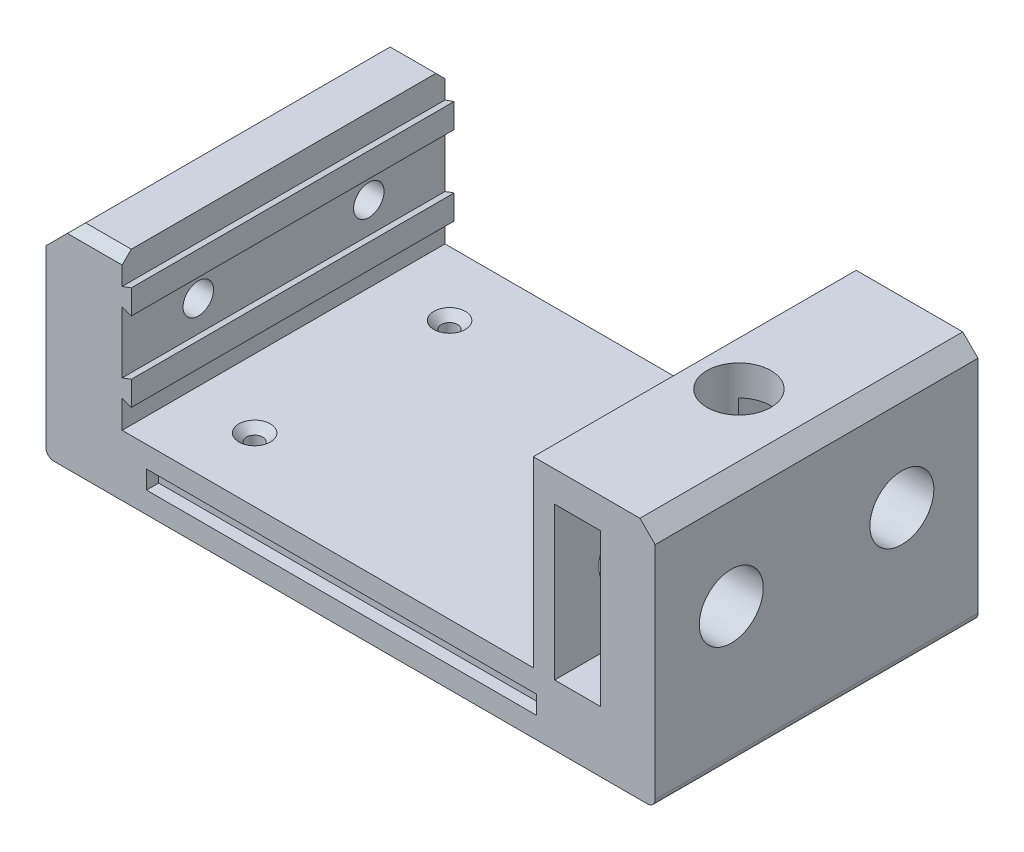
from build123d import *

# Parameters (mm, degrees)
EXTRUDE_1_DEPTH      = 53
SKETCH_2_R           = 10.5
CUT_EXTRUDE_1_DEPTH  = 179.910592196
SKETCH_3_W           = 15
SKETCH_3_H           = 50
CUT_EXTRUDE_2_DEPTH  = 163.456917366
CUT_EXTRUDE_3_REACH  = 146.102
SKETCH_4_R           = 10.5
SKETCH_5_R           = 10.5
CUT_EXTRUDE_4_DEPTH  = 8
SKETCH_6_R           = 7
CUT_EXTRUDE_5_DEPTH  = 138.801487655
SKETCH_7_R           = 13.5
CUT_EXTRUDE_6_DEPTH  = 7
SKETCH_8_R           = 5
CUT_EXTRUDE_7_DEPTH  = 193.442199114
SKETCH_9_W           = 128
SKETCH_9_H           = 6
CUT_EXTRUDE_8_DEPTH  = 4
EXTRUDE_2_DEPTH      = 106
CHAMFER_1_SIZE       = 5
CHAMFER_2_SIZE       = 3
FILLET_1_R           = 2.5
SKETCH_13_R          = 2.675
CUT_EXTRUDE_11_DEPTH = 135.034510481
CHAMFER_3_SIZE       = 2.5
CHAMFER_4_SIZE       = 2


with BuildPart() as part:
    # Sketch 1 → Extrude 1 (new, symmetric)
    with BuildSketch(Plane.XY):
        Polygon((-67.5, 0), (67.5, 0), (67.5, 60), (107.5, 60), (107.5, -20), (-92.5, -20), (-92.5, 40), (-82.5, 50), (-67.5, 50), align=None)
    extrude(amount=EXTRUDE_1_DEPTH, both=True)

    # Sketch 2 → Cut-Extrude 1 (cut, through all)
    with BuildSketch(Plane.ZY.offset(-67.5)):
        with Locations(Location((-28, 25, 0), (0, 0, 270))):
            Circle(SKETCH_2_R)
        with Locations(Location((28, 25, 0), (0, 0, 270))):
            Circle(SKETCH_2_R)
    extrude(amount=-CUT_EXTRUDE_1_DEPTH, mode=Mode.SUBTRACT)

    # Sketch 3 → Cut-Extrude 2 (cut, through all)
    with BuildSketch(Plane.XY.offset(53)):
        with Locations((82, 25)):
            Rectangle(SKETCH_3_W, SKETCH_3_H)
    extrude(amount=-CUT_EXTRUDE_2_DEPTH, mode=Mode.SUBTRACT)

    # Cut-Extrude 3: up to this face of the body (flat: up to its plane)
    cut_extrude_3_end = Plane(part.part.faces().sort_by_distance((82, 0, 0))[0])
    # Sketch 4 → Cut-Extrude 3 (cut, up to the picked face)
    with BuildSketch(Plane(origin=(0, 60, 0), x_dir=(1, 0, 0), z_dir=(0, 1, 0)), mode=Mode.PRIVATE) as cut_extrude_3_sk1:
        with Locations(Location((82, 0, 0), (0, 0, 270))):
            Circle(SKETCH_4_R)
    cut_extrude_3_tool1 = split(extrude(cut_extrude_3_sk1.sketch, amount=-CUT_EXTRUDE_3_REACH, mode=Mode.PRIVATE), bisect_by=cut_extrude_3_end, keep=Keep.BOTH, mode=Mode.PRIVATE)
    add(cut_extrude_3_tool1.solids().sort_by(Axis((82, 60, 0), (0, -1, 0)))[0], mode=Mode.SUBTRACT)

    # Sketch 5 → Cut-Extrude 4 (cut)
    with BuildSketch(Plane(origin=(0, 0, 0), x_dir=(1, 0, 0), z_dir=(0, 1, 0))):
        with Locations(Location((82, 0, 0), (0, 0, 270))):
            Circle(SKETCH_5_R)
    extrude(amount=-CUT_EXTRUDE_4_DEPTH, mode=Mode.SUBTRACT)

    # Sketch 6 → Cut-Extrude 5 (cut, through all)
    with BuildSketch(Plane(origin=(0, -8, 0), x_dir=(1, 0, 0), z_dir=(0, 1, 0))):
        with Locations(Location((82, 0, 0), (0, 0, 270))):
            Circle(SKETCH_6_R)
    extrude(amount=-CUT_EXTRUDE_5_DEPTH, mode=Mode.SUBTRACT)

    # Sketch 7 → Cut-Extrude 6 (cut)
    with BuildSketch(Plane.XZ.offset(20)):
        with Locations(Location((82, 0, 0), (0, 0, 270))):
            Circle(SKETCH_7_R)
    extrude(amount=-CUT_EXTRUDE_6_DEPTH, mode=Mode.SUBTRACT)

    # Sketch 8 → Cut-Extrude 7 (cut, through all)
    with BuildSketch(Plane(origin=(-67.5, 0, 0), x_dir=(0, 0, -1), z_dir=(1, 0, 0))):
        with Locations(Location((-28, 25, 0), (0, 0, 90))):
            Circle(SKETCH_8_R)
        with Locations(Location((28, 25, 0), (0, 0, 90))):
            Circle(SKETCH_8_R)
    extrude(amount=-CUT_EXTRUDE_7_DEPTH, mode=Mode.SUBTRACT)

    # Sketch 9 → Cut-Extrude 8 (cut)
    with BuildSketch(Plane.XY.offset(53)):
        with Locations((4.5, -10)):
            Rectangle(SKETCH_9_W, SKETCH_9_H)
    cut_extrude_8 = extrude(amount=-CUT_EXTRUDE_8_DEPTH, mode=Mode.SUBTRACT)

    # Mirror 1: Cut-Extrude 8 across plane
    add(cut_extrude_8.mirror(Plane.XY), mode=Mode.SUBTRACT)

    # Sketch 11 → Extrude 2 (add)
    with BuildSketch(Plane.XY.offset(53)):
        Polygon((-67.5, 40.908089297), (-64.5, 42), (-64.5, 34), (-67.5, 35.091910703), align=None)
        Polygon((-64.5, 8), (-64.5, 16), (-67.5, 14.908089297), (-67.5, 9.091910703), align=None)
    extrude(amount=-EXTRUDE_2_DEPTH)

    # Chamfer 1
    chamfer_1_edges = [part.edges().sort_by_distance(p)[0] for p in [
        (107.5, 60, 0),
    ]]
    chamfer(chamfer_1_edges, length=CHAMFER_1_SIZE)

    # Chamfer 2
    chamfer_2_edges = [part.edges().sort_by_distance(p)[0] for p in [
        (-75, 50, 53),
        (-75, 50, -53),
    ]]
    chamfer(chamfer_2_edges, length=CHAMFER_2_SIZE)

    # Fillet 1
    fillet_1_edges = [part.edges().sort_by_distance(p)[0] for p in [
        (-92.5, -20, 0),
        (107.5, -20, 0),
    ]]
    fillet(fillet_1_edges, radius=FILLET_1_R)

    # Sketch 13 → Cut-Extrude 11 (cut, through all)
    with BuildSketch(Plane(origin=(0, 0, 0), x_dir=(1, 0, 0), z_dir=(0, 1, 0))):
        with Locations(Location((-45, 32, 0), (0, 0, 180))):
            Circle(SKETCH_13_R)
        with Locations(Location((-45, -32, 0), (0, 0, 180))):
            Circle(SKETCH_13_R)
        with Locations(Location((45, 0, 0), (0, 0, 180))):
            Circle(SKETCH_13_R)
    extrude(amount=-CUT_EXTRUDE_11_DEPTH, mode=Mode.SUBTRACT)

    # Chamfer 3
    chamfer_3_edges = [part.edges().sort_by_distance(p)[0] for p in [
        (-42.325, 0, -32),
        (-42.325, 0, 32),
        (47.675, 0, 0),
    ]]
    chamfer(chamfer_3_edges, length=CHAMFER_3_SIZE)

    # Chamfer 4
    chamfer_4_edges = [part.edges().sort_by_distance(p)[0] for p in [
        (-42.325, -20, -32),
        (-42.325, -20, 32),
        (47.675, -20, 0),
    ]]
    chamfer(chamfer_4_edges, length=CHAMFER_4_SIZE)


solid = part.part
